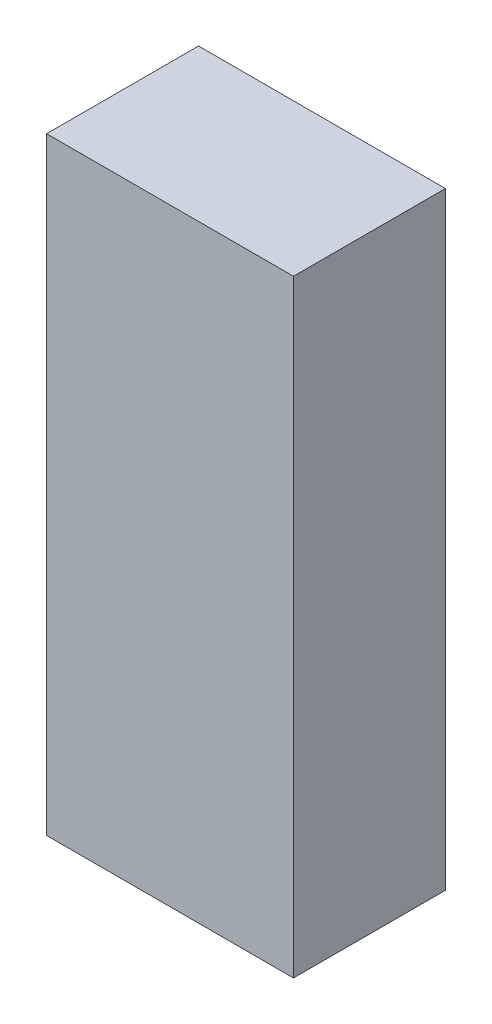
from build123d import *

# Parameters (mm, degrees)
SKETCH1_W           = 82.55
SKETCH1_H           = 50.8
BOSS_EXTRUDE1_DEPTH = 457.2
SKETCH2_W           = 82.55
SKETCH2_H           = 254
CUT_EXTRUDE1_DEPTH  = 462.861565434


with BuildPart() as part:
    # Sketch1 → Boss-Extrude1 (new body)
    with BuildSketch(Plane(origin=(0, 0, 0), x_dir=(1, 0, 0), z_dir=(0, 1, 0))):
        Rectangle(SKETCH1_W, SKETCH1_H)
    extrude(amount=BOSS_EXTRUDE1_DEPTH)

    # Sketch2 → Cut-Extrude1 (cut, through all)
    with BuildSketch(Plane(origin=(0, 0, -25.4), x_dir=(-1, 0, 0), z_dir=(0, 0, -1))):
        with Locations((0, 127)):
            Rectangle(SKETCH2_W, SKETCH2_H)
    extrude(amount=-CUT_EXTRUDE1_DEPTH, mode=Mode.SUBTRACT)


solid = part.part
